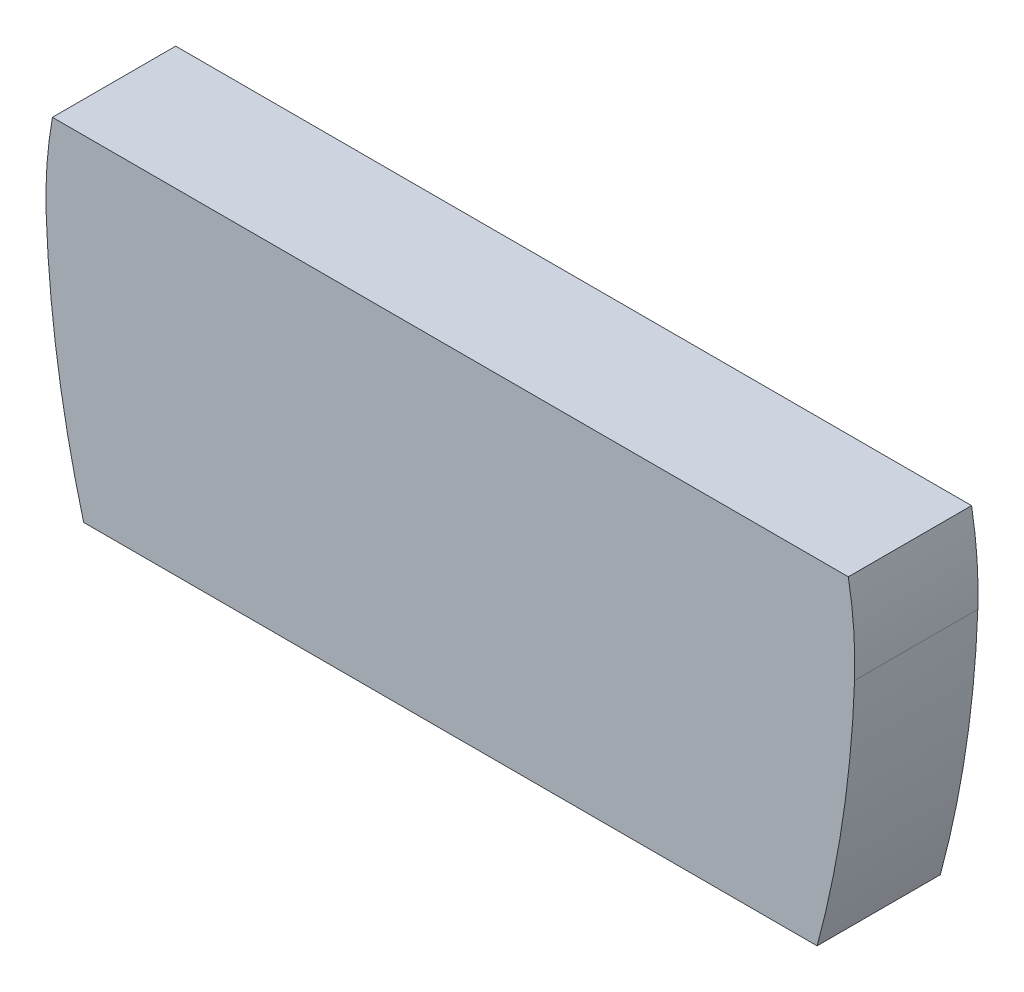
from build123d import *

# Parameters (mm, degrees)
LINEAR_AUSTRAGEN1_DEPTH = 5.47


with BuildPart() as part:
    # Skizze35 → Linear austragen1 (new body)
    with BuildSketch(Plane.XY.offset(-107.7276)):
        with BuildLine():
            Line((-16.275923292, 23.2381), (16.275923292, 23.2381))
            ThreePointArc((16.275923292, 23.2381), (17.421230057, 28.705900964), (17.938471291, 34.268367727))
            ThreePointArc((17.938471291, 34.268367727), (17.903674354, 36.200376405), (17.661399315, 38.11745))
            Line((17.661399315, 38.11745), (-17.661399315, 38.11745))
            ThreePointArc((-17.661399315, 38.11745), (-17.903674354, 36.200376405), (-17.938471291, 34.268367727))
            ThreePointArc((-17.938471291, 34.268367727), (-17.421230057, 28.705900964), (-16.275923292, 23.2381))
        make_face()
    extrude(amount=-LINEAR_AUSTRAGEN1_DEPTH)


solid = part.part
